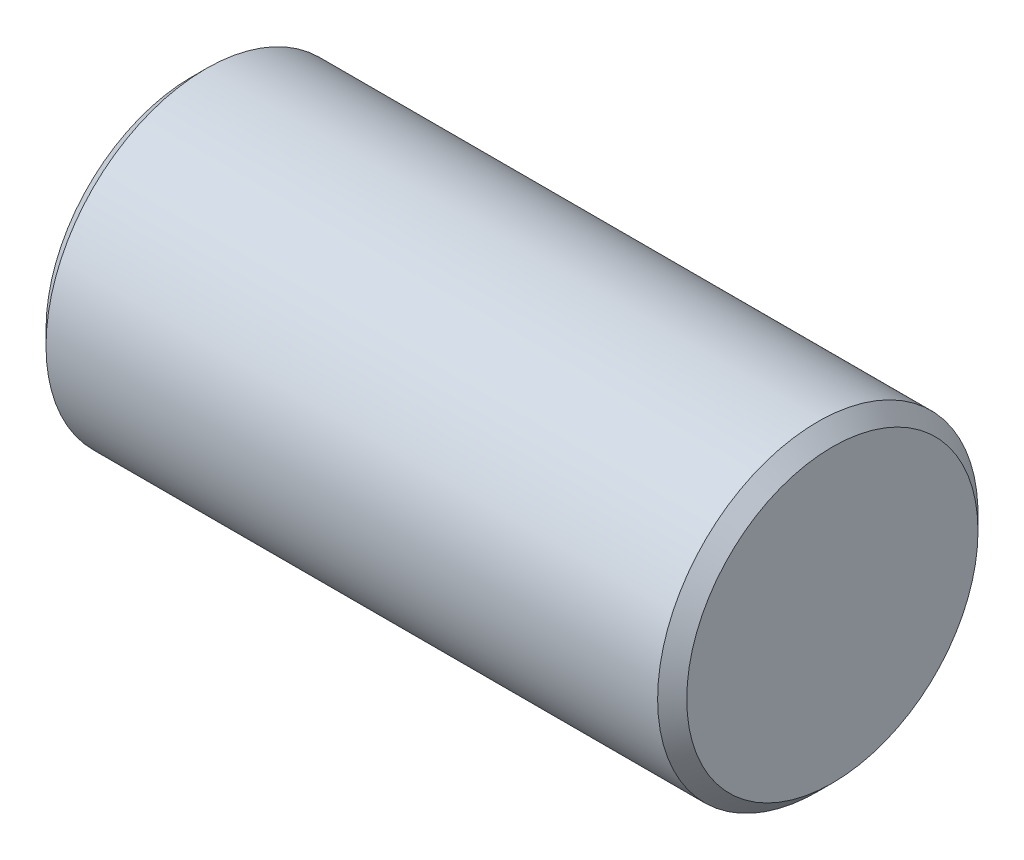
ISO-10303-21;
HEADER;
FILE_DESCRIPTION(('STEP AP214'),'2;1');
FILE_NAME('part.step','',(''),(''),'','','');
FILE_SCHEMA(('AUTOMOTIVE_DESIGN { 1 0 10303 214 1 1 1 1 }'));
ENDSEC;
DATA;
#1=APPLICATION_CONTEXT('core data for automotive mechanical design processes');
#2=APPLICATION_PROTOCOL_DEFINITION('international standard','automotive_design',2000,#1);
#3=PRODUCT_CONTEXT('',#1,'mechanical');
#4=PRODUCT('Part','Part','',(#3));
#5=PRODUCT_RELATED_PRODUCT_CATEGORY('part','',(#4));
#6=PRODUCT_DEFINITION_FORMATION('','',#4);
#7=PRODUCT_DEFINITION_CONTEXT('part definition',#1,'design');
#8=PRODUCT_DEFINITION('design','',#6,#7);
#9=PRODUCT_DEFINITION_SHAPE('','',#8);
#10=(LENGTH_UNIT() NAMED_UNIT(*) SI_UNIT(.MILLI.,.METRE.));
#11=(NAMED_UNIT(*) PLANE_ANGLE_UNIT() SI_UNIT($,.RADIAN.));
#12=(NAMED_UNIT(*) SI_UNIT($,.STERADIAN.) SOLID_ANGLE_UNIT());
#13=UNCERTAINTY_MEASURE_WITH_UNIT(LENGTH_MEASURE(1.E-05),#10,'distance_accuracy_value','');
#14=(GEOMETRIC_REPRESENTATION_CONTEXT(3) GLOBAL_UNCERTAINTY_ASSIGNED_CONTEXT((#13)) GLOBAL_UNIT_ASSIGNED_CONTEXT((#10,
#11,#12)) REPRESENTATION_CONTEXT('',''));
#15=CARTESIAN_POINT('',(0.,0.,0.));
#16=DIRECTION('',(0.,0.,1.));
#17=DIRECTION('',(1.,0.,0.));
#18=AXIS2_PLACEMENT_3D('',#15,#16,#17);
#19=CARTESIAN_POINT('',(0.,0.,0.));
#20=DIRECTION('',(1.,0.,0.));
#21=DIRECTION('',(0.,0.,-1.));
#22=AXIS2_PLACEMENT_3D('',#19,#20,#21);
#23=PLANE('',#22);
#24=CARTESIAN_POINT('',(0.,-11.,0.));
#25=DIRECTION('',(1.,0.,0.));
#26=DIRECTION('',(0.,0.,-1.));
#27=AXIS2_PLACEMENT_3D('',#24,#25,#26);
#28=CIRCLE('',#27,10.);
#29=CARTESIAN_POINT('',(0.,-11.,-10.));
#30=VERTEX_POINT('',#29);
#31=EDGE_CURVE('E10',#30,#30,#28,.F.);
#32=ORIENTED_EDGE('',*,*,#31,.T.);
#33=EDGE_LOOP('',(#32));
#34=FACE_BOUND('',#33,.T.);
#35=ADVANCED_FACE('F31',(#34),#23,.F.);
#36=CARTESIAN_POINT('',(44.,0.,0.));
#37=DIRECTION('',(-1.,0.,0.));
#38=DIRECTION('',(0.,0.,1.));
#39=AXIS2_PLACEMENT_3D('',#36,#37,#38);
#40=PLANE('',#39);
#41=CARTESIAN_POINT('',(44.,-11.,0.));
#42=DIRECTION('',(-1.,0.,0.));
#43=DIRECTION('',(0.,0.,1.));
#44=AXIS2_PLACEMENT_3D('',#41,#42,#43);
#45=CIRCLE('',#44,9.99999999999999);
#46=CARTESIAN_POINT('',(44.,-11.,9.99999999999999));
#47=VERTEX_POINT('',#46);
#48=EDGE_CURVE('E38',#47,#47,#45,.F.);
#49=ORIENTED_EDGE('',*,*,#48,.T.);
#50=EDGE_LOOP('',(#49));
#51=FACE_BOUND('',#50,.T.);
#52=ADVANCED_FACE('F62',(#51),#40,.F.);
#53=CARTESIAN_POINT('',(0.,-11.,0.));
#54=DIRECTION('',(-1.,0.,0.));
#55=DIRECTION('',(0.,0.,1.));
#56=AXIS2_PLACEMENT_3D('',#53,#54,#55);
#57=CYLINDRICAL_SURFACE('',#56,11.);
#58=CARTESIAN_POINT('',(43.,-11.,0.));
#59=DIRECTION('',(-1.,0.,0.));
#60=DIRECTION('',(0.,0.,1.));
#61=AXIS2_PLACEMENT_3D('',#58,#59,#60);
#62=CIRCLE('',#61,11.);
#63=CARTESIAN_POINT('',(43.,-11.,11.));
#64=VERTEX_POINT('',#63);
#65=EDGE_CURVE('E42',#64,#64,#62,.T.);
#66=ORIENTED_EDGE('',*,*,#65,.T.);
#67=EDGE_LOOP('',(#66));
#68=FACE_BOUND('',#67,.T.);
#69=CARTESIAN_POINT('',(1.,-11.,0.));
#70=DIRECTION('',(1.,0.,0.));
#71=DIRECTION('',(0.,0.,-1.));
#72=AXIS2_PLACEMENT_3D('',#69,#70,#71);
#73=CIRCLE('',#72,11.);
#74=CARTESIAN_POINT('',(1.,-11.,-11.));
#75=VERTEX_POINT('',#74);
#76=EDGE_CURVE('E46',#75,#75,#73,.T.);
#77=ORIENTED_EDGE('',*,*,#76,.T.);
#78=EDGE_LOOP('',(#77));
#79=FACE_BOUND('',#78,.T.);
#80=ADVANCED_FACE('F52',(#68,#79),#57,.T.);
#81=CARTESIAN_POINT('',(43.,-11.,0.));
#82=DIRECTION('',(-1.,0.,0.));
#83=DIRECTION('',(0.,0.,1.));
#84=AXIS2_PLACEMENT_3D('',#81,#82,#83);
#85=CONICAL_SURFACE('',#84,11.,0.785398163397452);
#86=ORIENTED_EDGE('',*,*,#48,.F.);
#87=EDGE_LOOP('',(#86));
#88=FACE_BOUND('',#87,.T.);
#89=ORIENTED_EDGE('',*,*,#65,.F.);
#90=EDGE_LOOP('',(#89));
#91=FACE_BOUND('',#90,.T.);
#92=ADVANCED_FACE('F56',(#88,#91),#85,.T.);
#93=CARTESIAN_POINT('',(0.,-11.,0.));
#94=DIRECTION('',(1.,0.,0.));
#95=DIRECTION('',(0.,0.,-1.));
#96=AXIS2_PLACEMENT_3D('',#93,#94,#95);
#97=CONICAL_SURFACE('',#96,10.,0.785398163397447);
#98=ORIENTED_EDGE('',*,*,#76,.F.);
#99=EDGE_LOOP('',(#98));
#100=FACE_BOUND('',#99,.T.);
#101=ORIENTED_EDGE('',*,*,#31,.F.);
#102=EDGE_LOOP('',(#101));
#103=FACE_BOUND('',#102,.T.);
#104=ADVANCED_FACE('F33',(#100,#103),#97,.T.);
#105=CLOSED_SHELL('',(#35,#52,#80,#92,#104));
#106=MANIFOLD_SOLID_BREP('B2',#105);
#107=ADVANCED_BREP_SHAPE_REPRESENTATION('',(#18,#106),#14);
#108=SHAPE_DEFINITION_REPRESENTATION(#9,#107);
ENDSEC;
END-ISO-10303-21;
